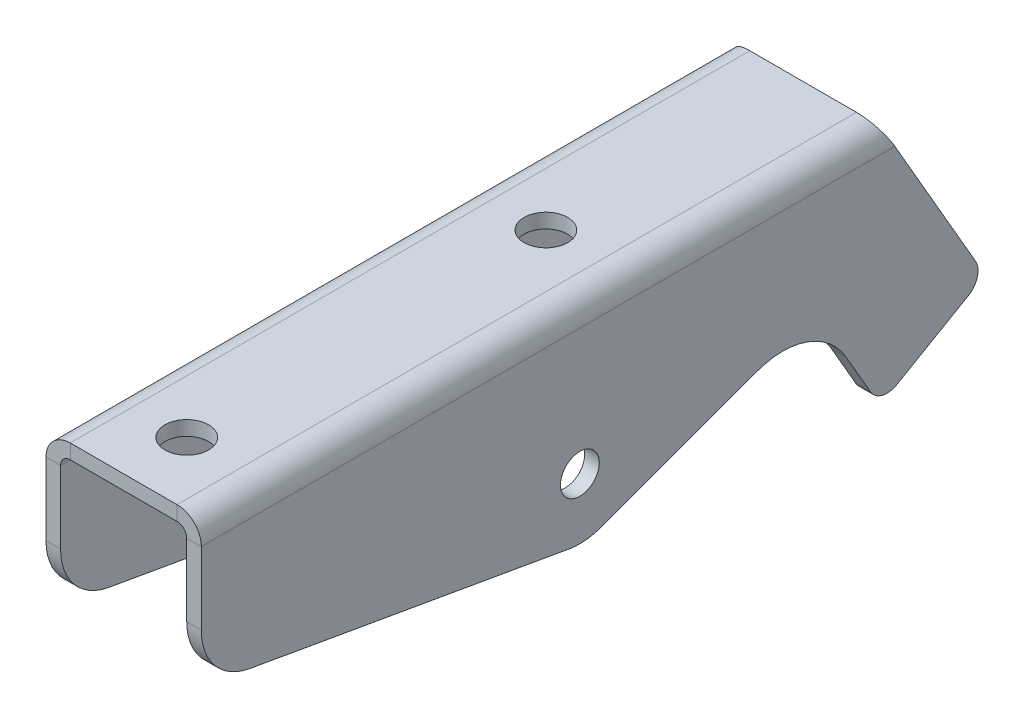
ISO-10303-21;
HEADER;
FILE_DESCRIPTION(('STEP AP214'),'2;1');
FILE_NAME('part.step','',(''),(''),'','','');
FILE_SCHEMA(('AUTOMOTIVE_DESIGN { 1 0 10303 214 1 1 1 1 }'));
ENDSEC;
DATA;
#1=APPLICATION_CONTEXT('core data for automotive mechanical design processes');
#2=APPLICATION_PROTOCOL_DEFINITION('international standard','automotive_design',2000,#1);
#3=PRODUCT_CONTEXT('',#1,'mechanical');
#4=PRODUCT('Part','Part','',(#3));
#5=PRODUCT_RELATED_PRODUCT_CATEGORY('part','',(#4));
#6=PRODUCT_DEFINITION_FORMATION('','',#4);
#7=PRODUCT_DEFINITION_CONTEXT('part definition',#1,'design');
#8=PRODUCT_DEFINITION('design','',#6,#7);
#9=PRODUCT_DEFINITION_SHAPE('','',#8);
#10=(LENGTH_UNIT() NAMED_UNIT(*) SI_UNIT(.MILLI.,.METRE.));
#11=(NAMED_UNIT(*) PLANE_ANGLE_UNIT() SI_UNIT($,.RADIAN.));
#12=(NAMED_UNIT(*) SI_UNIT($,.STERADIAN.) SOLID_ANGLE_UNIT());
#13=UNCERTAINTY_MEASURE_WITH_UNIT(LENGTH_MEASURE(1.E-05),#10,'distance_accuracy_value','');
#14=(GEOMETRIC_REPRESENTATION_CONTEXT(3) GLOBAL_UNCERTAINTY_ASSIGNED_CONTEXT((#13)) GLOBAL_UNIT_ASSIGNED_CONTEXT((#10,
#11,#12)) REPRESENTATION_CONTEXT('',''));
#15=CARTESIAN_POINT('',(0.,0.,0.));
#16=DIRECTION('',(0.,0.,1.));
#17=DIRECTION('',(1.,0.,0.));
#18=AXIS2_PLACEMENT_3D('',#15,#16,#17);
#19=CARTESIAN_POINT('',(11.,-3.,170.));
#20=DIRECTION('',(0.,0.,1.));
#21=DIRECTION('',(1.,0.,0.));
#22=AXIS2_PLACEMENT_3D('',#19,#20,#21);
#23=PLANE('',#22);
#24=DIRECTION('',(0.,-1.,0.));
#25=VECTOR('',#24,1.);
#26=CARTESIAN_POINT('',(13.,0.,170.));
#27=LINE('',#26,#25);
#28=CARTESIAN_POINT('',(13.,-4.99999999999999,170.));
#29=VERTEX_POINT('',#28);
#30=CARTESIAN_POINT('',(13.,-19.9228671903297,170.));
#31=VERTEX_POINT('',#30);
#32=EDGE_CURVE('E262',#29,#31,#27,.T.);
#33=ORIENTED_EDGE('',*,*,#32,.T.);
#34=DIRECTION('',(-1.,0.,0.));
#35=VECTOR('',#34,1.);
#36=CARTESIAN_POINT('',(11.,-19.9228671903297,170.));
#37=LINE('',#36,#35);
#38=CARTESIAN_POINT('',(16.,-19.9228671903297,170.));
#39=VERTEX_POINT('',#38);
#40=EDGE_CURVE('E312',#31,#39,#37,.F.);
#41=ORIENTED_EDGE('',*,*,#40,.T.);
#42=DIRECTION('',(0.,-1.,0.));
#43=VECTOR('',#42,1.);
#44=CARTESIAN_POINT('',(16.,0.,170.));
#45=LINE('',#44,#43);
#46=CARTESIAN_POINT('',(16.,-4.99999999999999,170.));
#47=VERTEX_POINT('',#46);
#48=EDGE_CURVE('E482',#47,#39,#45,.T.);
#49=ORIENTED_EDGE('',*,*,#48,.F.);
#50=DIRECTION('',(-1.,0.,0.));
#51=VECTOR('',#50,1.);
#52=CARTESIAN_POINT('',(16.,-4.99999999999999,170.));
#53=LINE('',#52,#51);
#54=EDGE_CURVE('E291',#47,#29,#53,.T.);
#55=ORIENTED_EDGE('',*,*,#54,.T.);
#56=EDGE_LOOP('',(#33,#41,#49,#55));
#57=FACE_BOUND('',#56,.T.);
#58=ADVANCED_FACE('F39',(#57),#23,.T.);
#59=CARTESIAN_POINT('',(13.,0.,170.));
#60=DIRECTION('',(1.,0.,0.));
#61=DIRECTION('',(0.,1.,0.));
#62=AXIS2_PLACEMENT_3D('',#59,#60,#61);
#63=PLANE('',#62);
#64=CARTESIAN_POINT('',(13.,-31.,92.));
#65=DIRECTION('',(1.,0.,0.));
#66=DIRECTION('',(0.,1.,0.));
#67=AXIS2_PLACEMENT_3D('',#64,#65,#66);
#68=CIRCLE('',#67,4.00000000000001);
#69=CARTESIAN_POINT('',(13.,-27.,92.));
#70=VERTEX_POINT('',#69);
#71=EDGE_CURVE('E302',#70,#70,#68,.T.);
#72=ORIENTED_EDGE('',*,*,#71,.T.);
#73=EDGE_LOOP('',(#72));
#74=FACE_BOUND('',#73,.T.);
#75=DIRECTION('',(0.,0.17288387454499,0.984942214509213));
#76=VECTOR('',#75,1.);
#77=CARTESIAN_POINT('',(13.,-29.1033349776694,175.108418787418));
#78=LINE('',#77,#76);
#79=CARTESIAN_POINT('',(13.,-43.3117776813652,94.1610484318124));
#80=VERTEX_POINT('',#79);
#81=CARTESIAN_POINT('',(13.,-31.7421737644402,160.07460649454));
#82=VERTEX_POINT('',#81);
#83=EDGE_CURVE('E236',#80,#82,#78,.T.);
#84=ORIENTED_EDGE('',*,*,#83,.T.);
#85=CARTESIAN_POINT('',(13.,-19.9228671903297,158.));
#86=DIRECTION('',(1.,0.,0.));
#87=DIRECTION('',(0.,1.,0.));
#88=AXIS2_PLACEMENT_3D('',#85,#86,#87);
#89=CIRCLE('',#88,12.);
#90=EDGE_CURVE('E11',#82,#31,#89,.F.);
#91=ORIENTED_EDGE('',*,*,#90,.T.);
#92=ORIENTED_EDGE('',*,*,#32,.F.);
#93=DIRECTION('',(0.,0.,-1.));
#94=VECTOR('',#93,1.);
#95=CARTESIAN_POINT('',(13.,-4.99999999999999,170.));
#96=LINE('',#95,#94);
#97=CARTESIAN_POINT('',(13.,-4.99999999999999,27.1132486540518));
#98=VERTEX_POINT('',#97);
#99=EDGE_CURVE('E254',#29,#98,#96,.T.);
#100=ORIENTED_EDGE('',*,*,#99,.T.);
#101=DIRECTION('',(0.,-0.866025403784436,-0.500000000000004));
#102=VECTOR('',#101,1.);
#103=CARTESIAN_POINT('',(13.,60.621778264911,65.0000000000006));
#104=LINE('',#103,#102);
#105=CARTESIAN_POINT('',(13.,-33.7749907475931,10.4999999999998));
#106=VERTEX_POINT('',#105);
#107=EDGE_CURVE('E226',#98,#106,#104,.T.);
#108=ORIENTED_EDGE('',*,*,#107,.T.);
#109=CARTESIAN_POINT('',(13.,-35.774990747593,13.9641016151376));
#110=DIRECTION('',(1.,0.,0.));
#111=DIRECTION('',(0.,1.,0.));
#112=AXIS2_PLACEMENT_3D('',#109,#110,#111);
#113=CIRCLE('',#112,4.);
#114=CARTESIAN_POINT('',(13.,-39.2390923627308,11.9641016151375));
#115=VERTEX_POINT('',#114);
#116=EDGE_CURVE('E417',#106,#115,#113,.F.);
#117=ORIENTED_EDGE('',*,*,#116,.T.);
#118=DIRECTION('',(0.,-0.500000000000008,0.866025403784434));
#119=VECTOR('',#118,1.);
#120=CARTESIAN_POINT('',(13.,-97.860870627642,113.499999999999));
#121=LINE('',#120,#119);
#122=CARTESIAN_POINT('',(13.,-47.7390923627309,26.6865334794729));
#123=VERTEX_POINT('',#122);
#124=EDGE_CURVE('E448',#115,#123,#121,.T.);
#125=ORIENTED_EDGE('',*,*,#124,.T.);
#126=CARTESIAN_POINT('',(13.,-44.2749907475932,28.686533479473));
#127=DIRECTION('',(1.,0.,0.));
#128=DIRECTION('',(0.,1.,0.));
#129=AXIS2_PLACEMENT_3D('',#126,#127,#128);
#130=CIRCLE('',#129,4.00000000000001);
#131=CARTESIAN_POINT('',(13.,-46.2749907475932,32.1506350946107));
#132=VERTEX_POINT('',#131);
#133=EDGE_CURVE('E445',#123,#132,#130,.F.);
#134=ORIENTED_EDGE('',*,*,#133,.T.);
#135=DIRECTION('',(0.,0.866025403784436,0.500000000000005));
#136=VECTOR('',#135,1.);
#137=CARTESIAN_POINT('',(13.,48.121778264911,86.6506350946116));
#138=LINE('',#137,#136);
#139=CARTESIAN_POINT('',(13.,-37.5207431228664,37.2049023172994));
#140=VERTEX_POINT('',#139);
#141=EDGE_CURVE('E442',#132,#140,#138,.T.);
#142=ORIENTED_EDGE('',*,*,#141,.T.);
#143=CARTESIAN_POINT('',(13.,-45.0207431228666,50.1952833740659));
#144=DIRECTION('',(1.,0.,0.));
#145=DIRECTION('',(0.,1.,0.));
#146=AXIS2_PLACEMENT_3D('',#143,#144,#145);
#147=CIRCLE('',#146,15.);
#148=CARTESIAN_POINT('',(13.,-30.929339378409,55.3365225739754));
#149=VERTEX_POINT('',#148);
#150=EDGE_CURVE('E439',#140,#149,#147,.T.);
#151=ORIENTED_EDGE('',*,*,#150,.T.);
#152=DIRECTION('',(0.,-0.342749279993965,0.939426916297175));
#153=VECTOR('',#152,1.);
#154=CARTESIAN_POINT('',(13.,-64.2161034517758,146.570797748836));
#155=LINE('',#154,#153);
#156=CARTESIAN_POINT('',(13.,-42.7428364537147,87.7156340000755));
#157=VERTEX_POINT('',#156);
#158=EDGE_CURVE('E436',#149,#157,#155,.T.);
#159=ORIENTED_EDGE('',*,*,#158,.T.);
#160=CARTESIAN_POINT('',(13.,-31.,92.));
#161=DIRECTION('',(1.,0.,0.));
#162=DIRECTION('',(0.,1.,0.));
#163=AXIS2_PLACEMENT_3D('',#160,#161,#162);
#164=CIRCLE('',#163,12.5);
#165=EDGE_CURVE('E433',#157,#80,#164,.F.);
#166=ORIENTED_EDGE('',*,*,#165,.T.);
#167=EDGE_LOOP('',(#84,#91,#92,#100,#108,#117,#125,#134,#142,#151,#159,#166));
#168=FACE_BOUND('',#167,.T.);
#169=ADVANCED_FACE('F260',(#74,#168),#63,.F.);
#170=CARTESIAN_POINT('',(16.,0.,170.));
#171=DIRECTION('',(1.,0.,0.));
#172=DIRECTION('',(0.,1.,0.));
#173=AXIS2_PLACEMENT_3D('',#170,#171,#172);
#174=PLANE('',#173);
#175=CARTESIAN_POINT('',(16.,-31.,92.));
#176=DIRECTION('',(1.,0.,0.));
#177=DIRECTION('',(0.,1.,0.));
#178=AXIS2_PLACEMENT_3D('',#175,#176,#177);
#179=CIRCLE('',#178,4.00000000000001);
#180=CARTESIAN_POINT('',(16.,-27.,92.));
#181=VERTEX_POINT('',#180);
#182=EDGE_CURVE('E473',#181,#181,#179,.T.);
#183=ORIENTED_EDGE('',*,*,#182,.F.);
#184=EDGE_LOOP('',(#183));
#185=FACE_BOUND('',#184,.T.);
#186=ORIENTED_EDGE('',*,*,#48,.T.);
#187=CARTESIAN_POINT('',(16.,-19.9228671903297,158.));
#188=DIRECTION('',(1.,0.,0.));
#189=DIRECTION('',(0.,1.,0.));
#190=AXIS2_PLACEMENT_3D('',#187,#188,#189);
#191=CIRCLE('',#190,12.);
#192=CARTESIAN_POINT('',(16.,-31.7421737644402,160.07460649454));
#193=VERTEX_POINT('',#192);
#194=EDGE_CURVE('E63',#39,#193,#191,.T.);
#195=ORIENTED_EDGE('',*,*,#194,.T.);
#196=DIRECTION('',(0.,0.17288387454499,0.984942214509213));
#197=VECTOR('',#196,1.);
#198=CARTESIAN_POINT('',(16.,-29.1033349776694,175.108418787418));
#199=LINE('',#198,#197);
#200=CARTESIAN_POINT('',(16.,-43.3117776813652,94.1610484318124));
#201=VERTEX_POINT('',#200);
#202=EDGE_CURVE('E416',#201,#193,#199,.T.);
#203=ORIENTED_EDGE('',*,*,#202,.F.);
#204=CARTESIAN_POINT('',(16.,-31.,92.));
#205=DIRECTION('',(1.,0.,0.));
#206=DIRECTION('',(0.,1.,0.));
#207=AXIS2_PLACEMENT_3D('',#204,#205,#206);
#208=CIRCLE('',#207,12.5);
#209=CARTESIAN_POINT('',(16.,-42.7428364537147,87.7156340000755));
#210=VERTEX_POINT('',#209);
#211=EDGE_CURVE('E429',#210,#201,#208,.F.);
#212=ORIENTED_EDGE('',*,*,#211,.F.);
#213=DIRECTION('',(0.,-0.342749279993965,0.939426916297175));
#214=VECTOR('',#213,1.);
#215=CARTESIAN_POINT('',(16.,-64.2161034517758,146.570797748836));
#216=LINE('',#215,#214);
#217=CARTESIAN_POINT('',(16.,-30.929339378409,55.3365225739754));
#218=VERTEX_POINT('',#217);
#219=EDGE_CURVE('E427',#218,#210,#216,.T.);
#220=ORIENTED_EDGE('',*,*,#219,.F.);
#221=CARTESIAN_POINT('',(16.,-45.0207431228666,50.1952833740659));
#222=DIRECTION('',(1.,0.,0.));
#223=DIRECTION('',(0.,1.,0.));
#224=AXIS2_PLACEMENT_3D('',#221,#222,#223);
#225=CIRCLE('',#224,15.);
#226=CARTESIAN_POINT('',(16.,-37.5207431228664,37.2049023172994));
#227=VERTEX_POINT('',#226);
#228=EDGE_CURVE('E425',#227,#218,#225,.T.);
#229=ORIENTED_EDGE('',*,*,#228,.F.);
#230=DIRECTION('',(0.,0.866025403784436,0.500000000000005));
#231=VECTOR('',#230,1.);
#232=CARTESIAN_POINT('',(16.,48.121778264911,86.6506350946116));
#233=LINE('',#232,#231);
#234=CARTESIAN_POINT('',(16.,-46.2749907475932,32.1506350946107));
#235=VERTEX_POINT('',#234);
#236=EDGE_CURVE('E423',#235,#227,#233,.T.);
#237=ORIENTED_EDGE('',*,*,#236,.F.);
#238=CARTESIAN_POINT('',(16.,-44.2749907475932,28.686533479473));
#239=DIRECTION('',(1.,0.,0.));
#240=DIRECTION('',(0.,1.,0.));
#241=AXIS2_PLACEMENT_3D('',#238,#239,#240);
#242=CIRCLE('',#241,4.00000000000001);
#243=CARTESIAN_POINT('',(16.,-47.7390923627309,26.6865334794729));
#244=VERTEX_POINT('',#243);
#245=EDGE_CURVE('E421',#244,#235,#242,.F.);
#246=ORIENTED_EDGE('',*,*,#245,.F.);
#247=DIRECTION('',(0.,-0.500000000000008,0.866025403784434));
#248=VECTOR('',#247,1.);
#249=CARTESIAN_POINT('',(16.,-97.860870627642,113.499999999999));
#250=LINE('',#249,#248);
#251=CARTESIAN_POINT('',(16.,-39.2390923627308,11.9641016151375));
#252=VERTEX_POINT('',#251);
#253=EDGE_CURVE('E419',#252,#244,#250,.T.);
#254=ORIENTED_EDGE('',*,*,#253,.F.);
#255=CARTESIAN_POINT('',(16.,-35.774990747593,13.9641016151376));
#256=DIRECTION('',(1.,0.,0.));
#257=DIRECTION('',(0.,1.,0.));
#258=AXIS2_PLACEMENT_3D('',#255,#256,#257);
#259=CIRCLE('',#258,4.);
#260=CARTESIAN_POINT('',(16.,-33.7749907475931,10.4999999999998));
#261=VERTEX_POINT('',#260);
#262=EDGE_CURVE('E247',#261,#252,#259,.F.);
#263=ORIENTED_EDGE('',*,*,#262,.F.);
#264=DIRECTION('',(0.,-0.866025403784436,-0.500000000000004));
#265=VECTOR('',#264,1.);
#266=CARTESIAN_POINT('',(16.,60.621778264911,65.0000000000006));
#267=LINE('',#266,#265);
#268=CARTESIAN_POINT('',(16.,-4.99999999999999,27.1132486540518));
#269=VERTEX_POINT('',#268);
#270=EDGE_CURVE('E414',#269,#261,#267,.T.);
#271=ORIENTED_EDGE('',*,*,#270,.F.);
#272=DIRECTION('',(0.,0.,-1.));
#273=VECTOR('',#272,1.);
#274=CARTESIAN_POINT('',(16.,-4.99999999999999,170.));
#275=LINE('',#274,#273);
#276=EDGE_CURVE('E286',#47,#269,#275,.T.);
#277=ORIENTED_EDGE('',*,*,#276,.F.);
#278=EDGE_LOOP('',(#186,#195,#203,#212,#220,#229,#237,#246,#254,#263,#271,#277));
#279=FACE_BOUND('',#278,.T.);
#280=ADVANCED_FACE('F597',(#185,#279),#174,.T.);
#281=CARTESIAN_POINT('',(11.,-4.99999999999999,170.));
#282=DIRECTION('',(0.,0.,-1.));
#283=DIRECTION('',(-1.,0.,0.));
#284=AXIS2_PLACEMENT_3D('',#281,#282,#283);
#285=CYLINDRICAL_SURFACE('',#284,4.99999999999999);
#286=ORIENTED_EDGE('',*,*,#276,.T.);
#287=CARTESIAN_POINT('',(11.,-4.99999999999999,27.1132486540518));
#288=DIRECTION('',(0.,-0.500000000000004,0.866025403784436));
#289=DIRECTION('',(0.,-0.866025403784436,-0.500000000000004));
#290=AXIS2_PLACEMENT_3D('',#287,#288,#289);
#291=ELLIPSE('',#290,5.77350269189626,4.99999999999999);
#292=CARTESIAN_POINT('',(11.,0.,30.));
#293=VERTEX_POINT('',#292);
#294=EDGE_CURVE('E246',#293,#269,#291,.F.);
#295=ORIENTED_EDGE('',*,*,#294,.F.);
#296=DIRECTION('',(0.,0.,-1.));
#297=VECTOR('',#296,1.);
#298=CARTESIAN_POINT('',(11.,0.,170.));
#299=LINE('',#298,#297);
#300=CARTESIAN_POINT('',(11.,0.,170.));
#301=VERTEX_POINT('',#300);
#302=EDGE_CURVE('E283',#301,#293,#299,.T.);
#303=ORIENTED_EDGE('',*,*,#302,.F.);
#304=CARTESIAN_POINT('',(11.,-4.99999999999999,170.));
#305=DIRECTION('',(0.,0.,1.));
#306=DIRECTION('',(1.,0.,0.));
#307=AXIS2_PLACEMENT_3D('',#304,#305,#306);
#308=CIRCLE('',#307,4.99999999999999);
#309=EDGE_CURVE('E484',#301,#47,#308,.F.);
#310=ORIENTED_EDGE('',*,*,#309,.T.);
#311=EDGE_LOOP('',(#286,#295,#303,#310));
#312=FACE_BOUND('',#311,.T.);
#313=ADVANCED_FACE('F712',(#312),#285,.T.);
#314=CARTESIAN_POINT('',(-16.,0.,170.));
#315=DIRECTION('',(0.,1.,0.));
#316=DIRECTION('',(-1.,0.,0.));
#317=AXIS2_PLACEMENT_3D('',#314,#315,#316);
#318=PLANE('',#317);
#319=CARTESIAN_POINT('',(0.,0.,83.));
#320=DIRECTION('',(0.,1.,0.));
#321=DIRECTION('',(-1.,0.,0.));
#322=AXIS2_PLACEMENT_3D('',#319,#320,#321);
#323=CIRCLE('',#322,4.5);
#324=CARTESIAN_POINT('',(-4.5,0.,83.));
#325=VERTEX_POINT('',#324);
#326=EDGE_CURVE('E329',#325,#325,#323,.T.);
#327=ORIENTED_EDGE('',*,*,#326,.F.);
#328=EDGE_LOOP('',(#327));
#329=FACE_BOUND('',#328,.T.);
#330=CARTESIAN_POINT('',(0.,0.,157.));
#331=DIRECTION('',(0.,1.,0.));
#332=DIRECTION('',(-1.,0.,0.));
#333=AXIS2_PLACEMENT_3D('',#330,#331,#332);
#334=CIRCLE('',#333,4.5);
#335=CARTESIAN_POINT('',(-4.5,0.,157.));
#336=VERTEX_POINT('',#335);
#337=EDGE_CURVE('E319',#336,#336,#334,.T.);
#338=ORIENTED_EDGE('',*,*,#337,.F.);
#339=EDGE_LOOP('',(#338));
#340=FACE_BOUND('',#339,.T.);
#341=ORIENTED_EDGE('',*,*,#302,.T.);
#342=DIRECTION('',(-1.,0.,0.));
#343=VECTOR('',#342,1.);
#344=CARTESIAN_POINT('',(274.833317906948,0.,30.));
#345=LINE('',#344,#343);
#346=CARTESIAN_POINT('',(-11.,0.,30.));
#347=VERTEX_POINT('',#346);
#348=EDGE_CURVE('E258',#293,#347,#345,.T.);
#349=ORIENTED_EDGE('',*,*,#348,.T.);
#350=DIRECTION('',(0.,0.,-1.));
#351=VECTOR('',#350,1.);
#352=CARTESIAN_POINT('',(-11.,0.,170.));
#353=LINE('',#352,#351);
#354=CARTESIAN_POINT('',(-11.,0.,170.));
#355=VERTEX_POINT('',#354);
#356=EDGE_CURVE('E280',#355,#347,#353,.T.);
#357=ORIENTED_EDGE('',*,*,#356,.F.);
#358=DIRECTION('',(1.,0.,0.));
#359=VECTOR('',#358,1.);
#360=CARTESIAN_POINT('',(-16.,0.,170.));
#361=LINE('',#360,#359);
#362=EDGE_CURVE('E487',#355,#301,#361,.T.);
#363=ORIENTED_EDGE('',*,*,#362,.T.);
#364=EDGE_LOOP('',(#341,#349,#357,#363));
#365=FACE_BOUND('',#364,.T.);
#366=ADVANCED_FACE('F515',(#329,#340,#365),#318,.T.);
#367=CARTESIAN_POINT('',(-11.,-4.99999999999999,170.));
#368=DIRECTION('',(0.,0.,-1.));
#369=DIRECTION('',(-1.,0.,0.));
#370=AXIS2_PLACEMENT_3D('',#367,#368,#369);
#371=CYLINDRICAL_SURFACE('',#370,4.99999999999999);
#372=ORIENTED_EDGE('',*,*,#356,.T.);
#373=CARTESIAN_POINT('',(-11.,-4.99999999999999,27.1132486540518));
#374=DIRECTION('',(0.,-0.500000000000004,0.866025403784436));
#375=DIRECTION('',(0.,-0.866025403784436,-0.500000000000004));
#376=AXIS2_PLACEMENT_3D('',#373,#374,#375);
#377=ELLIPSE('',#376,5.77350269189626,4.99999999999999);
#378=CARTESIAN_POINT('',(-16.,-4.99999999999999,27.1132486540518));
#379=VERTEX_POINT('',#378);
#380=EDGE_CURVE('E318',#379,#347,#377,.F.);
#381=ORIENTED_EDGE('',*,*,#380,.F.);
#382=DIRECTION('',(0.,0.,-1.));
#383=VECTOR('',#382,1.);
#384=CARTESIAN_POINT('',(-16.,-4.99999999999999,170.));
#385=LINE('',#384,#383);
#386=CARTESIAN_POINT('',(-16.,-4.99999999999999,170.));
#387=VERTEX_POINT('',#386);
#388=EDGE_CURVE('E277',#387,#379,#385,.T.);
#389=ORIENTED_EDGE('',*,*,#388,.F.);
#390=CARTESIAN_POINT('',(-11.,-4.99999999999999,170.));
#391=DIRECTION('',(0.,0.,1.));
#392=DIRECTION('',(1.,0.,0.));
#393=AXIS2_PLACEMENT_3D('',#390,#391,#392);
#394=CIRCLE('',#393,4.99999999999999);
#395=EDGE_CURVE('E490',#387,#355,#394,.F.);
#396=ORIENTED_EDGE('',*,*,#395,.T.);
#397=EDGE_LOOP('',(#372,#381,#389,#396));
#398=FACE_BOUND('',#397,.T.);
#399=ADVANCED_FACE('F519',(#398),#371,.T.);
#400=CARTESIAN_POINT('',(-16.,-50.,170.));
#401=DIRECTION('',(-1.,0.,0.));
#402=DIRECTION('',(0.,-1.,0.));
#403=AXIS2_PLACEMENT_3D('',#400,#401,#402);
#404=PLANE('',#403);
#405=CARTESIAN_POINT('',(-16.,-31.,92.));
#406=DIRECTION('',(1.,0.,0.));
#407=DIRECTION('',(0.,1.,0.));
#408=AXIS2_PLACEMENT_3D('',#405,#406,#407);
#409=CIRCLE('',#408,4.00000000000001);
#410=CARTESIAN_POINT('',(-16.,-27.,92.));
#411=VERTEX_POINT('',#410);
#412=EDGE_CURVE('E303',#411,#411,#409,.T.);
#413=ORIENTED_EDGE('',*,*,#412,.T.);
#414=EDGE_LOOP('',(#413));
#415=FACE_BOUND('',#414,.T.);
#416=DIRECTION('',(0.,-0.17288387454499,-0.984942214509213));
#417=VECTOR('',#416,1.);
#418=CARTESIAN_POINT('',(-16.,-30.5977766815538,166.594387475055));
#419=LINE('',#418,#417);
#420=CARTESIAN_POINT('',(-16.,-31.7421737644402,160.07460649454));
#421=VERTEX_POINT('',#420);
#422=CARTESIAN_POINT('',(-16.,-43.3117776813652,94.1610484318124));
#423=VERTEX_POINT('',#422);
#424=EDGE_CURVE('E349',#421,#423,#419,.T.);
#425=ORIENTED_EDGE('',*,*,#424,.F.);
#426=CARTESIAN_POINT('',(-16.,-19.9228671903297,158.));
#427=DIRECTION('',(-1.,0.,0.));
#428=DIRECTION('',(0.,-1.,0.));
#429=AXIS2_PLACEMENT_3D('',#426,#427,#428);
#430=CIRCLE('',#429,12.);
#431=CARTESIAN_POINT('',(-16.,-19.9228671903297,170.));
#432=VERTEX_POINT('',#431);
#433=EDGE_CURVE('E306',#421,#432,#430,.T.);
#434=ORIENTED_EDGE('',*,*,#433,.T.);
#435=DIRECTION('',(0.,1.,0.));
#436=VECTOR('',#435,1.);
#437=CARTESIAN_POINT('',(-16.,-50.,170.));
#438=LINE('',#437,#436);
#439=EDGE_CURVE('E493',#432,#387,#438,.T.);
#440=ORIENTED_EDGE('',*,*,#439,.T.);
#441=ORIENTED_EDGE('',*,*,#388,.T.);
#442=DIRECTION('',(0.,0.866025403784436,0.500000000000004));
#443=VECTOR('',#442,1.);
#444=CARTESIAN_POINT('',(-16.,23.1217782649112,43.3493649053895));
#445=LINE('',#444,#443);
#446=CARTESIAN_POINT('',(-16.,-33.7749907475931,10.4999999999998));
#447=VERTEX_POINT('',#446);
#448=EDGE_CURVE('E345',#447,#379,#445,.T.);
#449=ORIENTED_EDGE('',*,*,#448,.F.);
#450=CARTESIAN_POINT('',(-16.,-35.774990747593,13.9641016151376));
#451=DIRECTION('',(-1.,0.,0.));
#452=DIRECTION('',(0.,-1.,0.));
#453=AXIS2_PLACEMENT_3D('',#450,#451,#452);
#454=CIRCLE('',#453,4.);
#455=CARTESIAN_POINT('',(-16.,-39.2390923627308,11.9641016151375));
#456=VERTEX_POINT('',#455);
#457=EDGE_CURVE('E347',#456,#447,#454,.F.);
#458=ORIENTED_EDGE('',*,*,#457,.F.);
#459=DIRECTION('',(0.,0.500000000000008,-0.866025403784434));
#460=VECTOR('',#459,1.);
#461=CARTESIAN_POINT('',(-16.,-110.360870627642,135.15063509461));
#462=LINE('',#461,#460);
#463=CARTESIAN_POINT('',(-16.,-47.7390923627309,26.6865334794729));
#464=VERTEX_POINT('',#463);
#465=EDGE_CURVE('E362',#464,#456,#462,.T.);
#466=ORIENTED_EDGE('',*,*,#465,.F.);
#467=CARTESIAN_POINT('',(-16.,-44.2749907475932,28.686533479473));
#468=DIRECTION('',(-1.,0.,0.));
#469=DIRECTION('',(0.,-1.,0.));
#470=AXIS2_PLACEMENT_3D('',#467,#468,#469);
#471=CIRCLE('',#470,4.00000000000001);
#472=CARTESIAN_POINT('',(-16.,-46.2749907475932,32.1506350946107));
#473=VERTEX_POINT('',#472);
#474=EDGE_CURVE('E360',#473,#464,#471,.F.);
#475=ORIENTED_EDGE('',*,*,#474,.F.);
#476=DIRECTION('',(0.,-0.866025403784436,-0.500000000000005));
#477=VECTOR('',#476,1.);
#478=CARTESIAN_POINT('',(-16.,10.6217782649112,65.0000000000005));
#479=LINE('',#478,#477);
#480=CARTESIAN_POINT('',(-16.,-37.5207431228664,37.2049023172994));
#481=VERTEX_POINT('',#480);
#482=EDGE_CURVE('E358',#481,#473,#479,.T.);
#483=ORIENTED_EDGE('',*,*,#482,.F.);
#484=CARTESIAN_POINT('',(-16.,-45.0207431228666,50.1952833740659));
#485=DIRECTION('',(-1.,0.,0.));
#486=DIRECTION('',(0.,-1.,0.));
#487=AXIS2_PLACEMENT_3D('',#484,#485,#486);
#488=CIRCLE('',#487,15.);
#489=CARTESIAN_POINT('',(-16.,-30.929339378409,55.3365225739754));
#490=VERTEX_POINT('',#489);
#491=EDGE_CURVE('E356',#490,#481,#488,.T.);
#492=ORIENTED_EDGE('',*,*,#491,.F.);
#493=DIRECTION('',(0.,0.342749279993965,-0.939426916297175));
#494=VECTOR('',#493,1.);
#495=CARTESIAN_POINT('',(-16.,-70.0899568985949,162.670192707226));
#496=LINE('',#495,#494);
#497=CARTESIAN_POINT('',(-16.,-42.7428364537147,87.7156340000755));
#498=VERTEX_POINT('',#497);
#499=EDGE_CURVE('E354',#498,#490,#496,.T.);
#500=ORIENTED_EDGE('',*,*,#499,.F.);
#501=CARTESIAN_POINT('',(-16.,-31.,92.));
#502=DIRECTION('',(-1.,0.,0.));
#503=DIRECTION('',(0.,-1.,0.));
#504=AXIS2_PLACEMENT_3D('',#501,#502,#503);
#505=CIRCLE('',#504,12.5);
#506=EDGE_CURVE('E352',#423,#498,#505,.F.);
#507=ORIENTED_EDGE('',*,*,#506,.F.);
#508=EDGE_LOOP('',(#425,#434,#440,#441,#449,#458,#466,#475,#483,#492,#500,#507));
#509=FACE_BOUND('',#508,.T.);
#510=ADVANCED_FACE('F551',(#415,#509),#404,.T.);
#511=CARTESIAN_POINT('',(-13.,-50.,170.));
#512=DIRECTION('',(-1.,0.,0.));
#513=DIRECTION('',(0.,-1.,0.));
#514=AXIS2_PLACEMENT_3D('',#511,#512,#513);
#515=PLANE('',#514);
#516=CARTESIAN_POINT('',(-13.,-31.,92.));
#517=DIRECTION('',(-1.,0.,0.));
#518=DIRECTION('',(0.,-1.,0.));
#519=AXIS2_PLACEMENT_3D('',#516,#517,#518);
#520=CIRCLE('',#519,4.00000000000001);
#521=CARTESIAN_POINT('',(-13.,-35.,92.));
#522=VERTEX_POINT('',#521);
#523=EDGE_CURVE('E299',#522,#522,#520,.T.);
#524=ORIENTED_EDGE('',*,*,#523,.T.);
#525=EDGE_LOOP('',(#524));
#526=FACE_BOUND('',#525,.T.);
#527=DIRECTION('',(0.,1.,0.));
#528=VECTOR('',#527,1.);
#529=CARTESIAN_POINT('',(-13.,-50.,170.));
#530=LINE('',#529,#528);
#531=CARTESIAN_POINT('',(-13.,-19.9228671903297,170.));
#532=VERTEX_POINT('',#531);
#533=CARTESIAN_POINT('',(-13.,-4.99999999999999,170.));
#534=VERTEX_POINT('',#533);
#535=EDGE_CURVE('E495',#532,#534,#530,.T.);
#536=ORIENTED_EDGE('',*,*,#535,.F.);
#537=CARTESIAN_POINT('',(-13.,-19.9228671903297,158.));
#538=DIRECTION('',(-1.,0.,0.));
#539=DIRECTION('',(0.,-1.,0.));
#540=AXIS2_PLACEMENT_3D('',#537,#538,#539);
#541=CIRCLE('',#540,12.);
#542=CARTESIAN_POINT('',(-13.,-31.7421737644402,160.07460649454));
#543=VERTEX_POINT('',#542);
#544=EDGE_CURVE('E310',#532,#543,#541,.F.);
#545=ORIENTED_EDGE('',*,*,#544,.T.);
#546=DIRECTION('',(0.,-0.17288387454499,-0.984942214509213));
#547=VECTOR('',#546,1.);
#548=CARTESIAN_POINT('',(-13.,-30.5977766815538,166.594387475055));
#549=LINE('',#548,#547);
#550=CARTESIAN_POINT('',(-13.,-43.3117776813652,94.1610484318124));
#551=VERTEX_POINT('',#550);
#552=EDGE_CURVE('E348',#543,#551,#549,.T.);
#553=ORIENTED_EDGE('',*,*,#552,.T.);
#554=CARTESIAN_POINT('',(-13.,-31.,92.));
#555=DIRECTION('',(-1.,0.,0.));
#556=DIRECTION('',(0.,-1.,0.));
#557=AXIS2_PLACEMENT_3D('',#554,#555,#556);
#558=CIRCLE('',#557,12.5);
#559=CARTESIAN_POINT('',(-13.,-42.7428364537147,87.7156340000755));
#560=VERTEX_POINT('',#559);
#561=EDGE_CURVE('E385',#551,#560,#558,.F.);
#562=ORIENTED_EDGE('',*,*,#561,.T.);
#563=DIRECTION('',(0.,0.342749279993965,-0.939426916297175));
#564=VECTOR('',#563,1.);
#565=CARTESIAN_POINT('',(-13.,-70.0899568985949,162.670192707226));
#566=LINE('',#565,#564);
#567=CARTESIAN_POINT('',(-13.,-30.929339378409,55.3365225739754));
#568=VERTEX_POINT('',#567);
#569=EDGE_CURVE('E382',#560,#568,#566,.T.);
#570=ORIENTED_EDGE('',*,*,#569,.T.);
#571=CARTESIAN_POINT('',(-13.,-45.0207431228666,50.1952833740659));
#572=DIRECTION('',(-1.,0.,0.));
#573=DIRECTION('',(0.,-1.,0.));
#574=AXIS2_PLACEMENT_3D('',#571,#572,#573);
#575=CIRCLE('',#574,15.);
#576=CARTESIAN_POINT('',(-13.,-37.5207431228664,37.2049023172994));
#577=VERTEX_POINT('',#576);
#578=EDGE_CURVE('E379',#568,#577,#575,.T.);
#579=ORIENTED_EDGE('',*,*,#578,.T.);
#580=DIRECTION('',(0.,-0.866025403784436,-0.500000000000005));
#581=VECTOR('',#580,1.);
#582=CARTESIAN_POINT('',(-13.,10.6217782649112,65.0000000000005));
#583=LINE('',#582,#581);
#584=CARTESIAN_POINT('',(-13.,-46.2749907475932,32.1506350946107));
#585=VERTEX_POINT('',#584);
#586=EDGE_CURVE('E376',#577,#585,#583,.T.);
#587=ORIENTED_EDGE('',*,*,#586,.T.);
#588=CARTESIAN_POINT('',(-13.,-44.2749907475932,28.686533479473));
#589=DIRECTION('',(-1.,0.,0.));
#590=DIRECTION('',(0.,-1.,0.));
#591=AXIS2_PLACEMENT_3D('',#588,#589,#590);
#592=CIRCLE('',#591,4.00000000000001);
#593=CARTESIAN_POINT('',(-13.,-47.7390923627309,26.6865334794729));
#594=VERTEX_POINT('',#593);
#595=EDGE_CURVE('E373',#585,#594,#592,.F.);
#596=ORIENTED_EDGE('',*,*,#595,.T.);
#597=DIRECTION('',(0.,0.500000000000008,-0.866025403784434));
#598=VECTOR('',#597,1.);
#599=CARTESIAN_POINT('',(-13.,-110.360870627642,135.15063509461));
#600=LINE('',#599,#598);
#601=CARTESIAN_POINT('',(-13.,-39.2390923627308,11.9641016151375));
#602=VERTEX_POINT('',#601);
#603=EDGE_CURVE('E370',#594,#602,#600,.T.);
#604=ORIENTED_EDGE('',*,*,#603,.T.);
#605=CARTESIAN_POINT('',(-13.,-35.774990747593,13.9641016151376));
#606=DIRECTION('',(-1.,0.,0.));
#607=DIRECTION('',(0.,-1.,0.));
#608=AXIS2_PLACEMENT_3D('',#605,#606,#607);
#609=CIRCLE('',#608,4.);
#610=CARTESIAN_POINT('',(-13.,-33.7749907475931,10.4999999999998));
#611=VERTEX_POINT('',#610);
#612=EDGE_CURVE('E367',#602,#611,#609,.F.);
#613=ORIENTED_EDGE('',*,*,#612,.T.);
#614=DIRECTION('',(0.,0.866025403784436,0.500000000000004));
#615=VECTOR('',#614,1.);
#616=CARTESIAN_POINT('',(-13.,23.1217782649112,43.3493649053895));
#617=LINE('',#616,#615);
#618=CARTESIAN_POINT('',(-13.,-4.99999999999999,27.1132486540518));
#619=VERTEX_POINT('',#618);
#620=EDGE_CURVE('E342',#611,#619,#617,.T.);
#621=ORIENTED_EDGE('',*,*,#620,.T.);
#622=DIRECTION('',(0.,0.,-1.));
#623=VECTOR('',#622,1.);
#624=CARTESIAN_POINT('',(-13.,-4.99999999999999,170.));
#625=LINE('',#624,#623);
#626=EDGE_CURVE('E274',#534,#619,#625,.T.);
#627=ORIENTED_EDGE('',*,*,#626,.F.);
#628=EDGE_LOOP('',(#536,#545,#553,#562,#570,#579,#587,#596,#604,#613,#621,#627));
#629=FACE_BOUND('',#628,.T.);
#630=ADVANCED_FACE('F539',(#526,#629),#515,.F.);
#631=CARTESIAN_POINT('',(-11.,-4.99999999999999,170.));
#632=DIRECTION('',(0.,0.,-1.));
#633=DIRECTION('',(-1.,0.,0.));
#634=AXIS2_PLACEMENT_3D('',#631,#632,#633);
#635=CYLINDRICAL_SURFACE('',#634,1.99999999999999);
#636=CARTESIAN_POINT('',(-11.,-4.99999999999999,27.1132486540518));
#637=DIRECTION('',(0.,-0.82199493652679,0.569494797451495));
#638=DIRECTION('',(0.,-0.569494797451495,-0.821994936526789));
#639=AXIS2_PLACEMENT_3D('',#636,#637,#638);
#640=ELLIPSE('',#639,3.51188458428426,1.99999999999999);
#641=CARTESIAN_POINT('',(-11.,-3.,30.));
#642=VERTEX_POINT('',#641);
#643=EDGE_CURVE('E322',#619,#642,#640,.F.);
#644=ORIENTED_EDGE('',*,*,#643,.T.);
#645=DIRECTION('',(0.,0.,-1.));
#646=VECTOR('',#645,1.);
#647=CARTESIAN_POINT('',(-11.,-3.,170.));
#648=LINE('',#647,#646);
#649=CARTESIAN_POINT('',(-11.,-3.,170.));
#650=VERTEX_POINT('',#649);
#651=EDGE_CURVE('E265',#650,#642,#648,.T.);
#652=ORIENTED_EDGE('',*,*,#651,.F.);
#653=CARTESIAN_POINT('',(-11.,-4.99999999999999,170.));
#654=DIRECTION('',(0.,0.,1.));
#655=DIRECTION('',(1.,0.,0.));
#656=AXIS2_PLACEMENT_3D('',#653,#654,#655);
#657=CIRCLE('',#656,1.99999999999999);
#658=EDGE_CURVE('E497',#534,#650,#657,.F.);
#659=ORIENTED_EDGE('',*,*,#658,.F.);
#660=ORIENTED_EDGE('',*,*,#626,.T.);
#661=EDGE_LOOP('',(#644,#652,#659,#660));
#662=FACE_BOUND('',#661,.T.);
#663=ADVANCED_FACE('F528',(#662),#635,.F.);
#664=CARTESIAN_POINT('',(-16.,-3.,170.));
#665=DIRECTION('',(0.,1.,0.));
#666=DIRECTION('',(-1.,0.,0.));
#667=AXIS2_PLACEMENT_3D('',#664,#665,#666);
#668=PLANE('',#667);
#669=CARTESIAN_POINT('',(0.,-3.,83.));
#670=DIRECTION('',(0.,1.,0.));
#671=DIRECTION('',(-1.,0.,0.));
#672=AXIS2_PLACEMENT_3D('',#669,#670,#671);
#673=CIRCLE('',#672,4.5);
#674=CARTESIAN_POINT('',(-4.5,-3.,83.));
#675=VERTEX_POINT('',#674);
#676=EDGE_CURVE('E43',#675,#675,#673,.T.);
#677=ORIENTED_EDGE('',*,*,#676,.T.);
#678=EDGE_LOOP('',(#677));
#679=FACE_BOUND('',#678,.T.);
#680=CARTESIAN_POINT('',(0.,-3.,157.));
#681=DIRECTION('',(0.,1.,0.));
#682=DIRECTION('',(-1.,0.,0.));
#683=AXIS2_PLACEMENT_3D('',#680,#681,#682);
#684=CIRCLE('',#683,4.5);
#685=CARTESIAN_POINT('',(-4.5,-3.,157.));
#686=VERTEX_POINT('',#685);
#687=EDGE_CURVE('E316',#686,#686,#684,.T.);
#688=ORIENTED_EDGE('',*,*,#687,.T.);
#689=EDGE_LOOP('',(#688));
#690=FACE_BOUND('',#689,.T.);
#691=DIRECTION('',(-1.,0.,0.));
#692=VECTOR('',#691,1.);
#693=CARTESIAN_POINT('',(-16.,-3.,30.));
#694=LINE('',#693,#692);
#695=CARTESIAN_POINT('',(11.,-3.,30.));
#696=VERTEX_POINT('',#695);
#697=EDGE_CURVE('E335',#696,#642,#694,.T.);
#698=ORIENTED_EDGE('',*,*,#697,.F.);
#699=DIRECTION('',(0.,0.,-1.));
#700=VECTOR('',#699,1.);
#701=CARTESIAN_POINT('',(11.,-3.,170.));
#702=LINE('',#701,#700);
#703=CARTESIAN_POINT('',(11.,-3.,170.));
#704=VERTEX_POINT('',#703);
#705=EDGE_CURVE('E257',#704,#696,#702,.T.);
#706=ORIENTED_EDGE('',*,*,#705,.F.);
#707=DIRECTION('',(1.,0.,0.));
#708=VECTOR('',#707,1.);
#709=CARTESIAN_POINT('',(-16.,-3.,170.));
#710=LINE('',#709,#708);
#711=EDGE_CURVE('E268',#650,#704,#710,.T.);
#712=ORIENTED_EDGE('',*,*,#711,.F.);
#713=ORIENTED_EDGE('',*,*,#651,.T.);
#714=EDGE_LOOP('',(#698,#706,#712,#713));
#715=FACE_BOUND('',#714,.T.);
#716=ADVANCED_FACE('F507',(#679,#690,#715),#668,.F.);
#717=CARTESIAN_POINT('',(11.,-4.99999999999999,170.));
#718=DIRECTION('',(0.,0.,-1.));
#719=DIRECTION('',(-1.,0.,0.));
#720=AXIS2_PLACEMENT_3D('',#717,#718,#719);
#721=CYLINDRICAL_SURFACE('',#720,1.99999999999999);
#722=CARTESIAN_POINT('',(11.,-4.99999999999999,27.1132486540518));
#723=DIRECTION('',(0.,-0.82199493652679,0.569494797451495));
#724=DIRECTION('',(0.,-0.569494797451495,-0.821994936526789));
#725=AXIS2_PLACEMENT_3D('',#722,#723,#724);
#726=ELLIPSE('',#725,3.51188458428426,1.99999999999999);
#727=EDGE_CURVE('E243',#696,#98,#726,.F.);
#728=ORIENTED_EDGE('',*,*,#727,.T.);
#729=ORIENTED_EDGE('',*,*,#99,.F.);
#730=CARTESIAN_POINT('',(11.,-4.99999999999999,170.));
#731=DIRECTION('',(0.,0.,1.));
#732=DIRECTION('',(1.,0.,0.));
#733=AXIS2_PLACEMENT_3D('',#730,#731,#732);
#734=CIRCLE('',#733,1.99999999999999);
#735=EDGE_CURVE('E263',#704,#29,#734,.F.);
#736=ORIENTED_EDGE('',*,*,#735,.F.);
#737=ORIENTED_EDGE('',*,*,#705,.T.);
#738=EDGE_LOOP('',(#728,#729,#736,#737));
#739=FACE_BOUND('',#738,.T.);
#740=ADVANCED_FACE('F252',(#739),#721,.F.);
#741=CARTESIAN_POINT('',(11.,-4.99999999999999,170.));
#742=DIRECTION('',(0.,0.,1.));
#743=DIRECTION('',(1.,0.,0.));
#744=AXIS2_PLACEMENT_3D('',#741,#742,#743);
#745=PLANE('',#744);
#746=ORIENTED_EDGE('',*,*,#439,.F.);
#747=DIRECTION('',(1.,0.,0.));
#748=VECTOR('',#747,1.);
#749=CARTESIAN_POINT('',(11.,-19.9228671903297,170.));
#750=LINE('',#749,#748);
#751=EDGE_CURVE('E308',#432,#532,#750,.T.);
#752=ORIENTED_EDGE('',*,*,#751,.T.);
#753=ORIENTED_EDGE('',*,*,#535,.T.);
#754=DIRECTION('',(-1.,0.,0.));
#755=VECTOR('',#754,1.);
#756=CARTESIAN_POINT('',(-13.,-4.99999999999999,170.));
#757=LINE('',#756,#755);
#758=EDGE_CURVE('E293',#534,#387,#757,.T.);
#759=ORIENTED_EDGE('',*,*,#758,.T.);
#760=EDGE_LOOP('',(#746,#752,#753,#759));
#761=FACE_BOUND('',#760,.T.);
#762=ADVANCED_FACE('F556',(#761),#745,.T.);
#763=CARTESIAN_POINT('',(-11.,0.,170.));
#764=DIRECTION('',(0.,0.,1.));
#765=DIRECTION('',(1.,0.,0.));
#766=AXIS2_PLACEMENT_3D('',#763,#764,#765);
#767=PLANE('',#766);
#768=DIRECTION('',(0.,-1.,0.));
#769=VECTOR('',#768,1.);
#770=CARTESIAN_POINT('',(-11.,0.,170.));
#771=LINE('',#770,#769);
#772=EDGE_CURVE('E296',#355,#650,#771,.T.);
#773=ORIENTED_EDGE('',*,*,#772,.F.);
#774=ORIENTED_EDGE('',*,*,#395,.F.);
#775=ORIENTED_EDGE('',*,*,#758,.F.);
#776=ORIENTED_EDGE('',*,*,#658,.T.);
#777=EDGE_LOOP('',(#773,#774,#775,#776));
#778=FACE_BOUND('',#777,.T.);
#779=ADVANCED_FACE('F523',(#778),#767,.T.);
#780=CARTESIAN_POINT('',(-13.,-4.99999999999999,170.));
#781=DIRECTION('',(0.,0.,1.));
#782=DIRECTION('',(1.,0.,0.));
#783=AXIS2_PLACEMENT_3D('',#780,#781,#782);
#784=PLANE('',#783);
#785=ORIENTED_EDGE('',*,*,#362,.F.);
#786=ORIENTED_EDGE('',*,*,#772,.T.);
#787=ORIENTED_EDGE('',*,*,#711,.T.);
#788=DIRECTION('',(0.,1.,0.));
#789=VECTOR('',#788,1.);
#790=CARTESIAN_POINT('',(11.,-3.,170.));
#791=LINE('',#790,#789);
#792=EDGE_CURVE('E289',#704,#301,#791,.T.);
#793=ORIENTED_EDGE('',*,*,#792,.T.);
#794=EDGE_LOOP('',(#785,#786,#787,#793));
#795=FACE_BOUND('',#794,.T.);
#796=ADVANCED_FACE('F503',(#795),#784,.T.);
#797=CARTESIAN_POINT('',(16.,-4.99999999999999,170.));
#798=DIRECTION('',(0.,0.,1.));
#799=DIRECTION('',(1.,0.,0.));
#800=AXIS2_PLACEMENT_3D('',#797,#798,#799);
#801=PLANE('',#800);
#802=ORIENTED_EDGE('',*,*,#54,.F.);
#803=ORIENTED_EDGE('',*,*,#309,.F.);
#804=ORIENTED_EDGE('',*,*,#792,.F.);
#805=ORIENTED_EDGE('',*,*,#735,.T.);
#806=EDGE_LOOP('',(#802,#803,#804,#805));
#807=FACE_BOUND('',#806,.T.);
#808=ADVANCED_FACE('F509',(#807),#801,.T.);
#809=CARTESIAN_POINT('',(-16.,-31.,92.));
#810=DIRECTION('',(1.,0.,0.));
#811=DIRECTION('',(0.,1.,0.));
#812=AXIS2_PLACEMENT_3D('',#809,#810,#811);
#813=CYLINDRICAL_SURFACE('',#812,4.00000000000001);
#814=ORIENTED_EDGE('',*,*,#412,.F.);
#815=EDGE_LOOP('',(#814));
#816=FACE_BOUND('',#815,.T.);
#817=ORIENTED_EDGE('',*,*,#523,.F.);
#818=EDGE_LOOP('',(#817));
#819=FACE_BOUND('',#818,.T.);
#820=ADVANCED_FACE('F604',(#816,#819),#813,.F.);
#821=ORIENTED_EDGE('',*,*,#182,.T.);
#822=EDGE_LOOP('',(#821));
#823=FACE_BOUND('',#822,.T.);
#824=ORIENTED_EDGE('',*,*,#71,.F.);
#825=EDGE_LOOP('',(#824));
#826=FACE_BOUND('',#825,.T.);
#827=ADVANCED_FACE('F756',(#823,#826),#813,.F.);
#828=CARTESIAN_POINT('',(13.,-29.1033349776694,175.108418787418));
#829=DIRECTION('',(0.,0.984942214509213,-0.17288387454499));
#830=DIRECTION('',(0.,0.17288387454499,0.984942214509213));
#831=AXIS2_PLACEMENT_3D('',#828,#829,#830);
#832=PLANE('',#831);
#833=ORIENTED_EDGE('',*,*,#202,.T.);
#834=DIRECTION('',(1.,0.,0.));
#835=VECTOR('',#834,1.);
#836=CARTESIAN_POINT('',(13.,-31.7421737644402,160.07460649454));
#837=LINE('',#836,#835);
#838=EDGE_CURVE('E48',#193,#82,#837,.F.);
#839=ORIENTED_EDGE('',*,*,#838,.T.);
#840=ORIENTED_EDGE('',*,*,#83,.F.);
#841=DIRECTION('',(-1.,0.,0.));
#842=VECTOR('',#841,1.);
#843=CARTESIAN_POINT('',(13.,-43.3117776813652,94.1610484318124));
#844=LINE('',#843,#842);
#845=EDGE_CURVE('E471',#80,#201,#844,.F.);
#846=ORIENTED_EDGE('',*,*,#845,.T.);
#847=EDGE_LOOP('',(#833,#839,#840,#846));
#848=FACE_BOUND('',#847,.T.);
#849=ADVANCED_FACE('F751',(#848),#832,.F.);
#850=CARTESIAN_POINT('',(13.,-31.,92.));
#851=DIRECTION('',(1.,0.,0.));
#852=DIRECTION('',(0.,1.,0.));
#853=AXIS2_PLACEMENT_3D('',#850,#851,#852);
#854=CYLINDRICAL_SURFACE('',#853,12.5);
#855=ORIENTED_EDGE('',*,*,#845,.F.);
#856=ORIENTED_EDGE('',*,*,#165,.F.);
#857=DIRECTION('',(-1.,0.,0.));
#858=VECTOR('',#857,1.);
#859=CARTESIAN_POINT('',(13.,-42.7428364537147,87.7156340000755));
#860=LINE('',#859,#858);
#861=EDGE_CURVE('E468',#157,#210,#860,.F.);
#862=ORIENTED_EDGE('',*,*,#861,.T.);
#863=ORIENTED_EDGE('',*,*,#211,.T.);
#864=EDGE_LOOP('',(#855,#856,#862,#863));
#865=FACE_BOUND('',#864,.T.);
#866=ADVANCED_FACE('F755',(#865),#854,.T.);
#867=CARTESIAN_POINT('',(13.,-64.2161034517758,146.570797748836));
#868=DIRECTION('',(0.,0.939426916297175,0.342749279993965));
#869=DIRECTION('',(0.,-0.342749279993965,0.939426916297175));
#870=AXIS2_PLACEMENT_3D('',#867,#868,#869);
#871=PLANE('',#870);
#872=ORIENTED_EDGE('',*,*,#861,.F.);
#873=ORIENTED_EDGE('',*,*,#158,.F.);
#874=DIRECTION('',(-1.,0.,0.));
#875=VECTOR('',#874,1.);
#876=CARTESIAN_POINT('',(13.,-30.929339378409,55.3365225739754));
#877=LINE('',#876,#875);
#878=EDGE_CURVE('E465',#149,#218,#877,.F.);
#879=ORIENTED_EDGE('',*,*,#878,.T.);
#880=ORIENTED_EDGE('',*,*,#219,.T.);
#881=EDGE_LOOP('',(#872,#873,#879,#880));
#882=FACE_BOUND('',#881,.T.);
#883=ADVANCED_FACE('F770',(#882),#871,.F.);
#884=CARTESIAN_POINT('',(13.,-45.0207431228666,50.1952833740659));
#885=DIRECTION('',(1.,0.,0.));
#886=DIRECTION('',(0.,1.,0.));
#887=AXIS2_PLACEMENT_3D('',#884,#885,#886);
#888=CYLINDRICAL_SURFACE('',#887,15.);
#889=ORIENTED_EDGE('',*,*,#878,.F.);
#890=ORIENTED_EDGE('',*,*,#150,.F.);
#891=DIRECTION('',(-1.,0.,0.));
#892=VECTOR('',#891,1.);
#893=CARTESIAN_POINT('',(13.,-37.5207431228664,37.2049023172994));
#894=LINE('',#893,#892);
#895=EDGE_CURVE('E462',#140,#227,#894,.F.);
#896=ORIENTED_EDGE('',*,*,#895,.T.);
#897=ORIENTED_EDGE('',*,*,#228,.T.);
#898=EDGE_LOOP('',(#889,#890,#896,#897));
#899=FACE_BOUND('',#898,.T.);
#900=ADVANCED_FACE('F778',(#899),#888,.F.);
#901=CARTESIAN_POINT('',(13.,48.121778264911,86.6506350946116));
#902=DIRECTION('',(0.,0.500000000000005,-0.866025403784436));
#903=DIRECTION('',(0.,0.866025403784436,0.500000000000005));
#904=AXIS2_PLACEMENT_3D('',#901,#902,#903);
#905=PLANE('',#904);
#906=ORIENTED_EDGE('',*,*,#895,.F.);
#907=ORIENTED_EDGE('',*,*,#141,.F.);
#908=DIRECTION('',(-1.,0.,0.));
#909=VECTOR('',#908,1.);
#910=CARTESIAN_POINT('',(13.,-46.2749907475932,32.1506350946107));
#911=LINE('',#910,#909);
#912=EDGE_CURVE('E459',#132,#235,#911,.F.);
#913=ORIENTED_EDGE('',*,*,#912,.T.);
#914=ORIENTED_EDGE('',*,*,#236,.T.);
#915=EDGE_LOOP('',(#906,#907,#913,#914));
#916=FACE_BOUND('',#915,.T.);
#917=ADVANCED_FACE('F786',(#916),#905,.F.);
#918=CARTESIAN_POINT('',(13.,-44.2749907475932,28.686533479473));
#919=DIRECTION('',(1.,0.,0.));
#920=DIRECTION('',(0.,1.,0.));
#921=AXIS2_PLACEMENT_3D('',#918,#919,#920);
#922=CYLINDRICAL_SURFACE('',#921,4.00000000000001);
#923=ORIENTED_EDGE('',*,*,#912,.F.);
#924=ORIENTED_EDGE('',*,*,#133,.F.);
#925=DIRECTION('',(-1.,0.,0.));
#926=VECTOR('',#925,1.);
#927=CARTESIAN_POINT('',(13.,-47.7390923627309,26.6865334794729));
#928=LINE('',#927,#926);
#929=EDGE_CURVE('E456',#123,#244,#928,.F.);
#930=ORIENTED_EDGE('',*,*,#929,.T.);
#931=ORIENTED_EDGE('',*,*,#245,.T.);
#932=EDGE_LOOP('',(#923,#924,#930,#931));
#933=FACE_BOUND('',#932,.T.);
#934=ADVANCED_FACE('F794',(#933),#922,.T.);
#935=CARTESIAN_POINT('',(13.,-97.860870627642,113.499999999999));
#936=DIRECTION('',(0.,0.866025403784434,0.500000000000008));
#937=DIRECTION('',(0.,-0.500000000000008,0.866025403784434));
#938=AXIS2_PLACEMENT_3D('',#935,#936,#937);
#939=PLANE('',#938);
#940=ORIENTED_EDGE('',*,*,#929,.F.);
#941=ORIENTED_EDGE('',*,*,#124,.F.);
#942=DIRECTION('',(-1.,0.,0.));
#943=VECTOR('',#942,1.);
#944=CARTESIAN_POINT('',(13.,-39.2390923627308,11.9641016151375));
#945=LINE('',#944,#943);
#946=EDGE_CURVE('E453',#115,#252,#945,.F.);
#947=ORIENTED_EDGE('',*,*,#946,.T.);
#948=ORIENTED_EDGE('',*,*,#253,.T.);
#949=EDGE_LOOP('',(#940,#941,#947,#948));
#950=FACE_BOUND('',#949,.T.);
#951=ADVANCED_FACE('F802',(#950),#939,.F.);
#952=CARTESIAN_POINT('',(13.,-35.774990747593,13.9641016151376));
#953=DIRECTION('',(1.,0.,0.));
#954=DIRECTION('',(0.,1.,0.));
#955=AXIS2_PLACEMENT_3D('',#952,#953,#954);
#956=CYLINDRICAL_SURFACE('',#955,4.);
#957=ORIENTED_EDGE('',*,*,#946,.F.);
#958=ORIENTED_EDGE('',*,*,#116,.F.);
#959=DIRECTION('',(-1.,0.,0.));
#960=VECTOR('',#959,1.);
#961=CARTESIAN_POINT('',(13.,-33.7749907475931,10.4999999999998));
#962=LINE('',#961,#960);
#963=EDGE_CURVE('E232',#106,#261,#962,.F.);
#964=ORIENTED_EDGE('',*,*,#963,.T.);
#965=ORIENTED_EDGE('',*,*,#262,.T.);
#966=EDGE_LOOP('',(#957,#958,#964,#965));
#967=FACE_BOUND('',#966,.T.);
#968=ADVANCED_FACE('F810',(#967),#956,.T.);
#969=CARTESIAN_POINT('',(13.,60.621778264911,65.0000000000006));
#970=DIRECTION('',(0.,-0.500000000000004,0.866025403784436));
#971=DIRECTION('',(0.,-0.866025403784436,-0.500000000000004));
#972=AXIS2_PLACEMENT_3D('',#969,#970,#971);
#973=PLANE('',#972);
#974=ORIENTED_EDGE('',*,*,#963,.F.);
#975=ORIENTED_EDGE('',*,*,#107,.F.);
#976=DIRECTION('',(-1.,0.,0.));
#977=VECTOR('',#976,1.);
#978=CARTESIAN_POINT('',(13.,-4.99999999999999,27.1132486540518));
#979=LINE('',#978,#977);
#980=EDGE_CURVE('E229',#98,#269,#979,.F.);
#981=ORIENTED_EDGE('',*,*,#980,.T.);
#982=ORIENTED_EDGE('',*,*,#270,.T.);
#983=EDGE_LOOP('',(#974,#975,#981,#982));
#984=FACE_BOUND('',#983,.T.);
#985=ADVANCED_FACE('F228',(#984),#973,.F.);
#986=CARTESIAN_POINT('',(-13.,-110.360870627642,135.15063509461));
#987=DIRECTION('',(0.,0.866025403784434,0.500000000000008));
#988=DIRECTION('',(0.,0.500000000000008,-0.866025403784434));
#989=AXIS2_PLACEMENT_3D('',#986,#987,#988);
#990=PLANE('',#989);
#991=DIRECTION('',(1.,0.,0.));
#992=VECTOR('',#991,1.);
#993=CARTESIAN_POINT('',(-13.,-39.2390923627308,11.9641016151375));
#994=LINE('',#993,#992);
#995=EDGE_CURVE('E237',#602,#456,#994,.F.);
#996=ORIENTED_EDGE('',*,*,#995,.F.);
#997=ORIENTED_EDGE('',*,*,#603,.F.);
#998=DIRECTION('',(1.,0.,0.));
#999=VECTOR('',#998,1.);
#1000=CARTESIAN_POINT('',(-13.,-47.7390923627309,26.6865334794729));
#1001=LINE('',#1000,#999);
#1002=EDGE_CURVE('E407',#594,#464,#1001,.F.);
#1003=ORIENTED_EDGE('',*,*,#1002,.T.);
#1004=ORIENTED_EDGE('',*,*,#465,.T.);
#1005=EDGE_LOOP('',(#996,#997,#1003,#1004));
#1006=FACE_BOUND('',#1005,.T.);
#1007=ADVANCED_FACE('F545',(#1006),#990,.F.);
#1008=CARTESIAN_POINT('',(-13.,-44.2749907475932,28.686533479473));
#1009=DIRECTION('',(-1.,0.,0.));
#1010=DIRECTION('',(0.,-1.,0.));
#1011=AXIS2_PLACEMENT_3D('',#1008,#1009,#1010);
#1012=CYLINDRICAL_SURFACE('',#1011,4.00000000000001);
#1013=ORIENTED_EDGE('',*,*,#1002,.F.);
#1014=ORIENTED_EDGE('',*,*,#595,.F.);
#1015=DIRECTION('',(1.,0.,0.));
#1016=VECTOR('',#1015,1.);
#1017=CARTESIAN_POINT('',(-13.,-46.2749907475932,32.1506350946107));
#1018=LINE('',#1017,#1016);
#1019=EDGE_CURVE('E404',#585,#473,#1018,.F.);
#1020=ORIENTED_EDGE('',*,*,#1019,.T.);
#1021=ORIENTED_EDGE('',*,*,#474,.T.);
#1022=EDGE_LOOP('',(#1013,#1014,#1020,#1021));
#1023=FACE_BOUND('',#1022,.T.);
#1024=ADVANCED_FACE('F582',(#1023),#1012,.T.);
#1025=CARTESIAN_POINT('',(-13.,10.6217782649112,65.0000000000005));
#1026=DIRECTION('',(0.,0.500000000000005,-0.866025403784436));
#1027=DIRECTION('',(0.,-0.866025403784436,-0.500000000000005));
#1028=AXIS2_PLACEMENT_3D('',#1025,#1026,#1027);
#1029=PLANE('',#1028);
#1030=ORIENTED_EDGE('',*,*,#1019,.F.);
#1031=ORIENTED_EDGE('',*,*,#586,.F.);
#1032=DIRECTION('',(1.,0.,0.));
#1033=VECTOR('',#1032,1.);
#1034=CARTESIAN_POINT('',(-13.,-37.5207431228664,37.2049023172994));
#1035=LINE('',#1034,#1033);
#1036=EDGE_CURVE('E401',#577,#481,#1035,.F.);
#1037=ORIENTED_EDGE('',*,*,#1036,.T.);
#1038=ORIENTED_EDGE('',*,*,#482,.T.);
#1039=EDGE_LOOP('',(#1030,#1031,#1037,#1038));
#1040=FACE_BOUND('',#1039,.T.);
#1041=ADVANCED_FACE('F580',(#1040),#1029,.F.);
#1042=CARTESIAN_POINT('',(-13.,-45.0207431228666,50.1952833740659));
#1043=DIRECTION('',(-1.,0.,0.));
#1044=DIRECTION('',(0.,-1.,0.));
#1045=AXIS2_PLACEMENT_3D('',#1042,#1043,#1044);
#1046=CYLINDRICAL_SURFACE('',#1045,15.);
#1047=ORIENTED_EDGE('',*,*,#1036,.F.);
#1048=ORIENTED_EDGE('',*,*,#578,.F.);
#1049=DIRECTION('',(1.,0.,0.));
#1050=VECTOR('',#1049,1.);
#1051=CARTESIAN_POINT('',(-13.,-30.929339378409,55.3365225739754));
#1052=LINE('',#1051,#1050);
#1053=EDGE_CURVE('E398',#568,#490,#1052,.F.);
#1054=ORIENTED_EDGE('',*,*,#1053,.T.);
#1055=ORIENTED_EDGE('',*,*,#491,.T.);
#1056=EDGE_LOOP('',(#1047,#1048,#1054,#1055));
#1057=FACE_BOUND('',#1056,.T.);
#1058=ADVANCED_FACE('F577',(#1057),#1046,.F.);
#1059=CARTESIAN_POINT('',(-13.,-70.0899568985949,162.670192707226));
#1060=DIRECTION('',(0.,0.939426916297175,0.342749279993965));
#1061=DIRECTION('',(0.,0.342749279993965,-0.939426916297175));
#1062=AXIS2_PLACEMENT_3D('',#1059,#1060,#1061);
#1063=PLANE('',#1062);
#1064=ORIENTED_EDGE('',*,*,#1053,.F.);
#1065=ORIENTED_EDGE('',*,*,#569,.F.);
#1066=DIRECTION('',(1.,0.,0.));
#1067=VECTOR('',#1066,1.);
#1068=CARTESIAN_POINT('',(-13.,-42.7428364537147,87.7156340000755));
#1069=LINE('',#1068,#1067);
#1070=EDGE_CURVE('E395',#560,#498,#1069,.F.);
#1071=ORIENTED_EDGE('',*,*,#1070,.T.);
#1072=ORIENTED_EDGE('',*,*,#499,.T.);
#1073=EDGE_LOOP('',(#1064,#1065,#1071,#1072));
#1074=FACE_BOUND('',#1073,.T.);
#1075=ADVANCED_FACE('F574',(#1074),#1063,.F.);
#1076=CARTESIAN_POINT('',(-13.,-31.,92.));
#1077=DIRECTION('',(-1.,0.,0.));
#1078=DIRECTION('',(0.,-1.,0.));
#1079=AXIS2_PLACEMENT_3D('',#1076,#1077,#1078);
#1080=CYLINDRICAL_SURFACE('',#1079,12.5);
#1081=ORIENTED_EDGE('',*,*,#1070,.F.);
#1082=ORIENTED_EDGE('',*,*,#561,.F.);
#1083=DIRECTION('',(1.,0.,0.));
#1084=VECTOR('',#1083,1.);
#1085=CARTESIAN_POINT('',(-13.,-43.3117776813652,94.1610484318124));
#1086=LINE('',#1085,#1084);
#1087=EDGE_CURVE('E392',#551,#423,#1086,.F.);
#1088=ORIENTED_EDGE('',*,*,#1087,.T.);
#1089=ORIENTED_EDGE('',*,*,#506,.T.);
#1090=EDGE_LOOP('',(#1081,#1082,#1088,#1089));
#1091=FACE_BOUND('',#1090,.T.);
#1092=ADVANCED_FACE('F570',(#1091),#1080,.T.);
#1093=CARTESIAN_POINT('',(-13.,-30.5977766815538,166.594387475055));
#1094=DIRECTION('',(0.,0.984942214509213,-0.17288387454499));
#1095=DIRECTION('',(0.,-0.17288387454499,-0.984942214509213));
#1096=AXIS2_PLACEMENT_3D('',#1093,#1094,#1095);
#1097=PLANE('',#1096);
#1098=ORIENTED_EDGE('',*,*,#552,.F.);
#1099=DIRECTION('',(-1.,0.,0.));
#1100=VECTOR('',#1099,1.);
#1101=CARTESIAN_POINT('',(-13.,-31.7421737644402,160.07460649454));
#1102=LINE('',#1101,#1100);
#1103=EDGE_CURVE('E298',#543,#421,#1102,.T.);
#1104=ORIENTED_EDGE('',*,*,#1103,.T.);
#1105=ORIENTED_EDGE('',*,*,#424,.T.);
#1106=ORIENTED_EDGE('',*,*,#1087,.F.);
#1107=EDGE_LOOP('',(#1098,#1104,#1105,#1106));
#1108=FACE_BOUND('',#1107,.T.);
#1109=ADVANCED_FACE('F563',(#1108),#1097,.F.);
#1110=CARTESIAN_POINT('',(-13.,23.1217782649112,43.3493649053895));
#1111=DIRECTION('',(0.,-0.500000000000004,0.866025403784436));
#1112=DIRECTION('',(0.,0.866025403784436,0.500000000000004));
#1113=AXIS2_PLACEMENT_3D('',#1110,#1111,#1112);
#1114=PLANE('',#1113);
#1115=DIRECTION('',(1.,0.,0.));
#1116=VECTOR('',#1115,1.);
#1117=CARTESIAN_POINT('',(-13.,-4.99999999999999,27.1132486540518));
#1118=LINE('',#1117,#1116);
#1119=EDGE_CURVE('E389',#619,#379,#1118,.F.);
#1120=ORIENTED_EDGE('',*,*,#1119,.F.);
#1121=ORIENTED_EDGE('',*,*,#620,.F.);
#1122=DIRECTION('',(1.,0.,0.));
#1123=VECTOR('',#1122,1.);
#1124=CARTESIAN_POINT('',(-13.,-33.7749907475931,10.4999999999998));
#1125=LINE('',#1124,#1123);
#1126=EDGE_CURVE('E351',#611,#447,#1125,.F.);
#1127=ORIENTED_EDGE('',*,*,#1126,.T.);
#1128=ORIENTED_EDGE('',*,*,#448,.T.);
#1129=EDGE_LOOP('',(#1120,#1121,#1127,#1128));
#1130=FACE_BOUND('',#1129,.T.);
#1131=ADVANCED_FACE('F534',(#1130),#1114,.F.);
#1132=CARTESIAN_POINT('',(-13.,-35.774990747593,13.9641016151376));
#1133=DIRECTION('',(-1.,0.,0.));
#1134=DIRECTION('',(0.,-1.,0.));
#1135=AXIS2_PLACEMENT_3D('',#1132,#1133,#1134);
#1136=CYLINDRICAL_SURFACE('',#1135,4.);
#1137=ORIENTED_EDGE('',*,*,#612,.F.);
#1138=ORIENTED_EDGE('',*,*,#995,.T.);
#1139=ORIENTED_EDGE('',*,*,#457,.T.);
#1140=ORIENTED_EDGE('',*,*,#1126,.F.);
#1141=EDGE_LOOP('',(#1137,#1138,#1139,#1140));
#1142=FACE_BOUND('',#1141,.T.);
#1143=ADVANCED_FACE('F542',(#1142),#1136,.T.);
#1144=CARTESIAN_POINT('',(274.833317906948,0.,30.));
#1145=DIRECTION('',(0.,0.,-1.));
#1146=DIRECTION('',(-1.,0.,0.));
#1147=AXIS2_PLACEMENT_3D('',#1144,#1145,#1146);
#1148=PLANE('',#1147);
#1149=ORIENTED_EDGE('',*,*,#348,.F.);
#1150=DIRECTION('',(0.,1.,0.));
#1151=VECTOR('',#1150,1.);
#1152=CARTESIAN_POINT('',(11.,0.,30.));
#1153=LINE('',#1152,#1151);
#1154=EDGE_CURVE('E340',#293,#696,#1153,.F.);
#1155=ORIENTED_EDGE('',*,*,#1154,.T.);
#1156=ORIENTED_EDGE('',*,*,#697,.T.);
#1157=DIRECTION('',(0.,1.,0.));
#1158=VECTOR('',#1157,1.);
#1159=CARTESIAN_POINT('',(-11.,0.,30.));
#1160=LINE('',#1159,#1158);
#1161=EDGE_CURVE('E337',#347,#642,#1160,.F.);
#1162=ORIENTED_EDGE('',*,*,#1161,.F.);
#1163=EDGE_LOOP('',(#1149,#1155,#1156,#1162));
#1164=FACE_BOUND('',#1163,.T.);
#1165=ADVANCED_FACE('F619',(#1164),#1148,.T.);
#1166=CARTESIAN_POINT('',(11.,-9.99999999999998,24.2264973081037));
#1167=CARTESIAN_POINT('',(11.,-8.99999999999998,24.2264973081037));
#1168=CARTESIAN_POINT('',(11.,-7.99999999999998,24.2264973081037));
#1169=CARTESIAN_POINT('',(11.,-6.99999999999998,24.2264973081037));
#1170=CARTESIAN_POINT('',(1.00000000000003,-9.99999999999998,24.2264973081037));
#1171=CARTESIAN_POINT('',(3.00000000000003,-8.99999999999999,24.2264973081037));
#1172=CARTESIAN_POINT('',(5.00000000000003,-7.99999999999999,24.2264973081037));
#1173=CARTESIAN_POINT('',(7.00000000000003,-6.99999999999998,24.2264973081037));
#1174=CARTESIAN_POINT('',(1.00000000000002,0.,30.));
#1175=CARTESIAN_POINT('',(3.00000000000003,-0.999999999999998,30.));
#1176=CARTESIAN_POINT('',(5.00000000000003,-2.,30.));
#1177=CARTESIAN_POINT('',(7.00000000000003,-3.,30.));
#1178=CARTESIAN_POINT('',(11.,0.,30.));
#1179=CARTESIAN_POINT('',(11.,-0.999999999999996,30.));
#1180=CARTESIAN_POINT('',(11.,-2.,30.));
#1181=CARTESIAN_POINT('',(11.,-3.,30.));
#1182=CARTESIAN_POINT('',(21.,0.,30.));
#1183=CARTESIAN_POINT('',(19.,-0.999999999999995,30.));
#1184=CARTESIAN_POINT('',(17.,-2.,30.));
#1185=CARTESIAN_POINT('',(15.,-3.,30.));
#1186=CARTESIAN_POINT('',(21.,-9.99999999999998,24.2264973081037));
#1187=CARTESIAN_POINT('',(19.,-8.99999999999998,24.2264973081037));
#1188=CARTESIAN_POINT('',(17.,-7.99999999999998,24.2264973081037));
#1189=CARTESIAN_POINT('',(15.,-6.99999999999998,24.2264973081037));
#1190=CARTESIAN_POINT('',(11.,-9.99999999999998,24.2264973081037));
#1191=CARTESIAN_POINT('',(11.,-8.99999999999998,24.2264973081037));
#1192=CARTESIAN_POINT('',(11.,-7.99999999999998,24.2264973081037));
#1193=CARTESIAN_POINT('',(11.,-6.99999999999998,24.2264973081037));
#1194=(BOUNDED_SURFACE() B_SPLINE_SURFACE(3,3,((#1166,#1167,#1168,#1169),(#1170,#1171,#1172,
#1173),(#1174,#1175,#1176,#1177),(#1178,#1179,#1180,#1181),(#1182,#1183,#1184,#1185),(#1186,
#1187,#1188,#1189),(#1190,#1191,#1192,#1193)),.UNSPECIFIED.,.T.,.F.,
.F.) B_SPLINE_SURFACE_WITH_KNOTS((4,3,4),(4,4),(0.,0.5,1.),(0.,1.),
.UNSPECIFIED.) GEOMETRIC_REPRESENTATION_ITEM() RATIONAL_B_SPLINE_SURFACE(((1.,1.,1.,1.),
(0.333333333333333,0.333333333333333,0.333333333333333,0.333333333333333),(0.333333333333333,
0.333333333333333,0.333333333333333,0.333333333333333),(1.,1.,1.,1.),(0.333333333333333,
0.333333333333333,0.333333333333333,0.333333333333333),(0.333333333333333,0.333333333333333,
0.333333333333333,0.333333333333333),(1.,1.,1.,1.))) REPRESENTATION_ITEM('') SURFACE());
#1195=ORIENTED_EDGE('',*,*,#294,.T.);
#1196=ORIENTED_EDGE('',*,*,#980,.F.);
#1197=ORIENTED_EDGE('',*,*,#727,.F.);
#1198=ORIENTED_EDGE('',*,*,#1154,.F.);
#1199=EDGE_LOOP('',(#1195,#1196,#1197,#1198));
#1200=FACE_BOUND('',#1199,.T.);
#1201=ADVANCED_FACE('F241',(#1200),#1194,.T.);
#1202=CARTESIAN_POINT('',(-11.,-9.99999999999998,24.2264973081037));
#1203=CARTESIAN_POINT('',(-11.,-8.99999999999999,24.2264973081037));
#1204=CARTESIAN_POINT('',(-11.,-7.99999999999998,24.2264973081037));
#1205=CARTESIAN_POINT('',(-11.,-6.99999999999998,24.2264973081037));
#1206=CARTESIAN_POINT('',(-21.,-9.99999999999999,24.2264973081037));
#1207=CARTESIAN_POINT('',(-19.,-8.99999999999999,24.2264973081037));
#1208=CARTESIAN_POINT('',(-17.,-7.99999999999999,24.2264973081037));
#1209=CARTESIAN_POINT('',(-15.,-6.99999999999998,24.2264973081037));
#1210=CARTESIAN_POINT('',(-21.,0.,30.));
#1211=CARTESIAN_POINT('',(-19.,-0.999999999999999,30.));
#1212=CARTESIAN_POINT('',(-17.,-2.,30.));
#1213=CARTESIAN_POINT('',(-15.,-3.,30.));
#1214=CARTESIAN_POINT('',(-11.,0.,30.));
#1215=CARTESIAN_POINT('',(-11.,-0.999999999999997,30.));
#1216=CARTESIAN_POINT('',(-11.,-2.,30.));
#1217=CARTESIAN_POINT('',(-11.,-3.,30.));
#1218=CARTESIAN_POINT('',(-1.00000000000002,0.,30.));
#1219=CARTESIAN_POINT('',(-3.00000000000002,-0.999999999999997,30.));
#1220=CARTESIAN_POINT('',(-5.00000000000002,-2.,30.));
#1221=CARTESIAN_POINT('',(-7.00000000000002,-3.,30.));
#1222=CARTESIAN_POINT('',(-1.00000000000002,-9.99999999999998,24.2264973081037));
#1223=CARTESIAN_POINT('',(-3.00000000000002,-8.99999999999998,24.2264973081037));
#1224=CARTESIAN_POINT('',(-5.00000000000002,-7.99999999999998,24.2264973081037));
#1225=CARTESIAN_POINT('',(-7.00000000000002,-6.99999999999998,24.2264973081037));
#1226=CARTESIAN_POINT('',(-11.,-9.99999999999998,24.2264973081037));
#1227=CARTESIAN_POINT('',(-11.,-8.99999999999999,24.2264973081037));
#1228=CARTESIAN_POINT('',(-11.,-7.99999999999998,24.2264973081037));
#1229=CARTESIAN_POINT('',(-11.,-6.99999999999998,24.2264973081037));
#1230=(BOUNDED_SURFACE() B_SPLINE_SURFACE(3,3,((#1202,#1203,#1204,#1205),(#1206,#1207,#1208,
#1209),(#1210,#1211,#1212,#1213),(#1214,#1215,#1216,#1217),(#1218,#1219,#1220,#1221),(#1222,
#1223,#1224,#1225),(#1226,#1227,#1228,#1229)),.UNSPECIFIED.,.T.,.F.,
.F.) B_SPLINE_SURFACE_WITH_KNOTS((4,3,4),(4,4),(0.,0.5,1.),(0.,1.),
.UNSPECIFIED.) GEOMETRIC_REPRESENTATION_ITEM() RATIONAL_B_SPLINE_SURFACE(((1.,1.,1.,1.),
(0.333333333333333,0.333333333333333,0.333333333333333,0.333333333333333),(0.333333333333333,
0.333333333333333,0.333333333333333,0.333333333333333),(1.,1.,1.,1.),(0.333333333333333,
0.333333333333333,0.333333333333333,0.333333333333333),(0.333333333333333,0.333333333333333,
0.333333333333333,0.333333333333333),(1.,1.,1.,1.))) REPRESENTATION_ITEM('') SURFACE());
#1231=ORIENTED_EDGE('',*,*,#380,.T.);
#1232=ORIENTED_EDGE('',*,*,#1161,.T.);
#1233=ORIENTED_EDGE('',*,*,#643,.F.);
#1234=ORIENTED_EDGE('',*,*,#1119,.T.);
#1235=EDGE_LOOP('',(#1231,#1232,#1233,#1234));
#1236=FACE_BOUND('',#1235,.T.);
#1237=ADVANCED_FACE('F531',(#1236),#1230,.T.);
#1238=CARTESIAN_POINT('',(-13.,-19.9228671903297,158.));
#1239=DIRECTION('',(1.,0.,0.));
#1240=DIRECTION('',(0.,1.,0.));
#1241=AXIS2_PLACEMENT_3D('',#1238,#1239,#1240);
#1242=CYLINDRICAL_SURFACE('',#1241,12.);
#1243=ORIENTED_EDGE('',*,*,#544,.F.);
#1244=ORIENTED_EDGE('',*,*,#751,.F.);
#1245=ORIENTED_EDGE('',*,*,#433,.F.);
#1246=ORIENTED_EDGE('',*,*,#1103,.F.);
#1247=EDGE_LOOP('',(#1243,#1244,#1245,#1246));
#1248=FACE_BOUND('',#1247,.T.);
#1249=ADVANCED_FACE('F561',(#1248),#1242,.T.);
#1250=CARTESIAN_POINT('',(11.,-19.9228671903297,158.));
#1251=DIRECTION('',(-1.,0.,0.));
#1252=DIRECTION('',(0.,-1.,0.));
#1253=AXIS2_PLACEMENT_3D('',#1250,#1251,#1252);
#1254=CYLINDRICAL_SURFACE('',#1253,12.);
#1255=ORIENTED_EDGE('',*,*,#90,.F.);
#1256=ORIENTED_EDGE('',*,*,#838,.F.);
#1257=ORIENTED_EDGE('',*,*,#194,.F.);
#1258=ORIENTED_EDGE('',*,*,#40,.F.);
#1259=EDGE_LOOP('',(#1255,#1256,#1257,#1258));
#1260=FACE_BOUND('',#1259,.T.);
#1261=ADVANCED_FACE('F41',(#1260),#1254,.T.);
#1262=CARTESIAN_POINT('',(0.,-48.2749907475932,157.));
#1263=DIRECTION('',(0.,1.,0.));
#1264=DIRECTION('',(-1.,0.,0.));
#1265=AXIS2_PLACEMENT_3D('',#1262,#1263,#1264);
#1266=CYLINDRICAL_SURFACE('',#1265,4.5);
#1267=ORIENTED_EDGE('',*,*,#337,.T.);
#1268=EDGE_LOOP('',(#1267));
#1269=FACE_BOUND('',#1268,.T.);
#1270=ORIENTED_EDGE('',*,*,#687,.F.);
#1271=EDGE_LOOP('',(#1270));
#1272=FACE_BOUND('',#1271,.T.);
#1273=ADVANCED_FACE('F613',(#1269,#1272),#1266,.F.);
#1274=CARTESIAN_POINT('',(0.,-48.2749907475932,83.));
#1275=DIRECTION('',(0.,1.,0.));
#1276=DIRECTION('',(-1.,0.,0.));
#1277=AXIS2_PLACEMENT_3D('',#1274,#1275,#1276);
#1278=CYLINDRICAL_SURFACE('',#1277,4.5);
#1279=ORIENTED_EDGE('',*,*,#326,.T.);
#1280=EDGE_LOOP('',(#1279));
#1281=FACE_BOUND('',#1280,.T.);
#1282=ORIENTED_EDGE('',*,*,#676,.F.);
#1283=EDGE_LOOP('',(#1282));
#1284=FACE_BOUND('',#1283,.T.);
#1285=ADVANCED_FACE('F880',(#1281,#1284),#1278,.F.);
#1286=CLOSED_SHELL('',(#58,#169,#280,#313,#366,#399,#510,#630,#663,#716,#740,#762,#779,#796,
#808,#820,#827,#849,#866,#883,#900,#917,#934,#951,#968,#985,#1007,#1024,#1041,#1058,#1075,#1092,
#1109,#1131,#1143,#1165,#1201,#1237,#1249,#1261,#1273,#1285));
#1287=MANIFOLD_SOLID_BREP('B2',#1286);
#1288=ADVANCED_BREP_SHAPE_REPRESENTATION('',(#18,#1287),#14);
#1289=SHAPE_DEFINITION_REPRESENTATION(#9,#1288);
ENDSEC;
END-ISO-10303-21;
